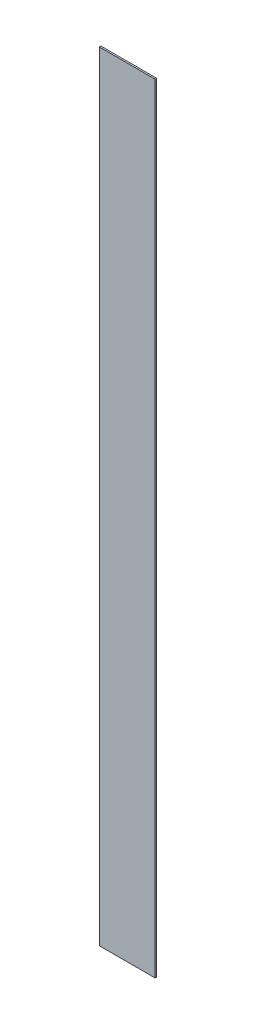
ISO-10303-21;
HEADER;
FILE_DESCRIPTION(('STEP AP214'),'2;1');
FILE_NAME('part.step','',(''),(''),'','','');
FILE_SCHEMA(('AUTOMOTIVE_DESIGN { 1 0 10303 214 1 1 1 1 }'));
ENDSEC;
DATA;
#1=APPLICATION_CONTEXT('core data for automotive mechanical design processes');
#2=APPLICATION_PROTOCOL_DEFINITION('international standard','automotive_design',2000,#1);
#3=PRODUCT_CONTEXT('',#1,'mechanical');
#4=PRODUCT('Part','Part','',(#3));
#5=PRODUCT_RELATED_PRODUCT_CATEGORY('part','',(#4));
#6=PRODUCT_DEFINITION_FORMATION('','',#4);
#7=PRODUCT_DEFINITION_CONTEXT('part definition',#1,'design');
#8=PRODUCT_DEFINITION('design','',#6,#7);
#9=PRODUCT_DEFINITION_SHAPE('','',#8);
#10=(LENGTH_UNIT() NAMED_UNIT(*) SI_UNIT(.MILLI.,.METRE.));
#11=(NAMED_UNIT(*) PLANE_ANGLE_UNIT() SI_UNIT($,.RADIAN.));
#12=(NAMED_UNIT(*) SI_UNIT($,.STERADIAN.) SOLID_ANGLE_UNIT());
#13=UNCERTAINTY_MEASURE_WITH_UNIT(LENGTH_MEASURE(1.E-05),#10,'distance_accuracy_value','');
#14=(GEOMETRIC_REPRESENTATION_CONTEXT(3) GLOBAL_UNCERTAINTY_ASSIGNED_CONTEXT((#13)) GLOBAL_UNIT_ASSIGNED_CONTEXT((#10,
#11,#12)) REPRESENTATION_CONTEXT('',''));
#15=CARTESIAN_POINT('',(0.,0.,0.));
#16=DIRECTION('',(0.,0.,1.));
#17=DIRECTION('',(1.,0.,0.));
#18=AXIS2_PLACEMENT_3D('',#15,#16,#17);
#19=CARTESIAN_POINT('',(-71.0000000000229,-184.799999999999,1.2));
#20=DIRECTION('',(1.,0.,0.));
#21=DIRECTION('',(0.,0.,-1.));
#22=AXIS2_PLACEMENT_3D('',#19,#20,#21);
#23=PLANE('',#22);
#24=DIRECTION('',(0.,-1.,0.));
#25=VECTOR('',#24,1.);
#26=CARTESIAN_POINT('',(-71.0000000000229,-184.799999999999,0.));
#27=LINE('',#26,#25);
#28=CARTESIAN_POINT('',(-71.0000000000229,400.200000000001,0.));
#29=VERTEX_POINT('',#28);
#30=CARTESIAN_POINT('',(-71.0000000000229,-184.799999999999,0.));
#31=VERTEX_POINT('',#30);
#32=EDGE_CURVE('E102',#29,#31,#27,.T.);
#33=ORIENTED_EDGE('',*,*,#32,.T.);
#34=DIRECTION('',(0.,0.,-1.));
#35=VECTOR('',#34,1.);
#36=CARTESIAN_POINT('',(-71.0000000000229,-184.799999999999,1.2));
#37=LINE('',#36,#35);
#38=CARTESIAN_POINT('',(-71.0000000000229,-184.799999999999,1.2));
#39=VERTEX_POINT('',#38);
#40=EDGE_CURVE('E11',#39,#31,#37,.T.);
#41=ORIENTED_EDGE('',*,*,#40,.F.);
#42=DIRECTION('',(0.,-1.,0.));
#43=VECTOR('',#42,1.);
#44=CARTESIAN_POINT('',(-71.0000000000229,-184.799999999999,1.2));
#45=LINE('',#44,#43);
#46=CARTESIAN_POINT('',(-71.0000000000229,400.200000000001,1.2));
#47=VERTEX_POINT('',#46);
#48=EDGE_CURVE('E90',#47,#39,#45,.T.);
#49=ORIENTED_EDGE('',*,*,#48,.F.);
#50=DIRECTION('',(0.,0.,-1.));
#51=VECTOR('',#50,1.);
#52=CARTESIAN_POINT('',(-71.0000000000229,400.200000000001,1.2));
#53=LINE('',#52,#51);
#54=EDGE_CURVE('E98',#47,#29,#53,.T.);
#55=ORIENTED_EDGE('',*,*,#54,.T.);
#56=EDGE_LOOP('',(#33,#41,#49,#55));
#57=FACE_BOUND('',#56,.T.);
#58=ADVANCED_FACE('F39',(#57),#23,.F.);
#59=CARTESIAN_POINT('',(-71.0000000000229,-184.799999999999,1.2));
#60=DIRECTION('',(0.,1.,0.));
#61=DIRECTION('',(0.,0.,1.));
#62=AXIS2_PLACEMENT_3D('',#59,#60,#61);
#63=PLANE('',#62);
#64=DIRECTION('',(1.,0.,0.));
#65=VECTOR('',#64,1.);
#66=CARTESIAN_POINT('',(-71.0000000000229,-184.799999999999,0.));
#67=LINE('',#66,#65);
#68=CARTESIAN_POINT('',(-29.0000000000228,-184.799999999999,0.));
#69=VERTEX_POINT('',#68);
#70=EDGE_CURVE('E94',#31,#69,#67,.T.);
#71=ORIENTED_EDGE('',*,*,#70,.T.);
#72=DIRECTION('',(0.,0.,-1.));
#73=VECTOR('',#72,1.);
#74=CARTESIAN_POINT('',(-29.0000000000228,-184.799999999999,1.2));
#75=LINE('',#74,#73);
#76=CARTESIAN_POINT('',(-29.0000000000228,-184.799999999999,1.2));
#77=VERTEX_POINT('',#76);
#78=EDGE_CURVE('E47',#77,#69,#75,.T.);
#79=ORIENTED_EDGE('',*,*,#78,.F.);
#80=DIRECTION('',(1.,0.,0.));
#81=VECTOR('',#80,1.);
#82=CARTESIAN_POINT('',(-71.0000000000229,-184.799999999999,1.2));
#83=LINE('',#82,#81);
#84=EDGE_CURVE('E85',#39,#77,#83,.T.);
#85=ORIENTED_EDGE('',*,*,#84,.F.);
#86=ORIENTED_EDGE('',*,*,#40,.T.);
#87=EDGE_LOOP('',(#71,#79,#85,#86));
#88=FACE_BOUND('',#87,.T.);
#89=ADVANCED_FACE('F93',(#88),#63,.F.);
#90=CARTESIAN_POINT('',(-29.0000000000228,-184.799999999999,1.2));
#91=DIRECTION('',(-1.,0.,0.));
#92=DIRECTION('',(0.,0.,1.));
#93=AXIS2_PLACEMENT_3D('',#90,#91,#92);
#94=PLANE('',#93);
#95=DIRECTION('',(0.,1.,0.));
#96=VECTOR('',#95,1.);
#97=CARTESIAN_POINT('',(-29.0000000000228,-184.799999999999,0.));
#98=LINE('',#97,#96);
#99=CARTESIAN_POINT('',(-29.0000000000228,400.200000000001,0.));
#100=VERTEX_POINT('',#99);
#101=EDGE_CURVE('E72',#69,#100,#98,.T.);
#102=ORIENTED_EDGE('',*,*,#101,.T.);
#103=DIRECTION('',(0.,0.,-1.));
#104=VECTOR('',#103,1.);
#105=CARTESIAN_POINT('',(-29.0000000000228,400.200000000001,1.2));
#106=LINE('',#105,#104);
#107=CARTESIAN_POINT('',(-29.0000000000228,400.200000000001,1.2));
#108=VERTEX_POINT('',#107);
#109=EDGE_CURVE('E95',#108,#100,#106,.T.);
#110=ORIENTED_EDGE('',*,*,#109,.F.);
#111=DIRECTION('',(0.,1.,0.));
#112=VECTOR('',#111,1.);
#113=CARTESIAN_POINT('',(-29.0000000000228,-184.799999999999,1.2));
#114=LINE('',#113,#112);
#115=EDGE_CURVE('E88',#77,#108,#114,.T.);
#116=ORIENTED_EDGE('',*,*,#115,.F.);
#117=ORIENTED_EDGE('',*,*,#78,.T.);
#118=EDGE_LOOP('',(#102,#110,#116,#117));
#119=FACE_BOUND('',#118,.T.);
#120=ADVANCED_FACE('F96',(#119),#94,.F.);
#121=CARTESIAN_POINT('',(-71.0000000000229,400.200000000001,1.2));
#122=DIRECTION('',(0.,-1.,0.));
#123=DIRECTION('',(0.,0.,-1.));
#124=AXIS2_PLACEMENT_3D('',#121,#122,#123);
#125=PLANE('',#124);
#126=DIRECTION('',(-1.,0.,0.));
#127=VECTOR('',#126,1.);
#128=CARTESIAN_POINT('',(-71.0000000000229,400.200000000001,0.));
#129=LINE('',#128,#127);
#130=EDGE_CURVE('E78',#100,#29,#129,.T.);
#131=ORIENTED_EDGE('',*,*,#130,.T.);
#132=ORIENTED_EDGE('',*,*,#54,.F.);
#133=DIRECTION('',(-1.,0.,0.));
#134=VECTOR('',#133,1.);
#135=CARTESIAN_POINT('',(-71.0000000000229,400.200000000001,1.2));
#136=LINE('',#135,#134);
#137=EDGE_CURVE('E55',#108,#47,#136,.T.);
#138=ORIENTED_EDGE('',*,*,#137,.F.);
#139=ORIENTED_EDGE('',*,*,#109,.T.);
#140=EDGE_LOOP('',(#131,#132,#138,#139));
#141=FACE_BOUND('',#140,.T.);
#142=ADVANCED_FACE('F109',(#141),#125,.F.);
#143=CARTESIAN_POINT('',(0.,0.,1.2));
#144=DIRECTION('',(0.,0.,-1.));
#145=DIRECTION('',(-1.,0.,0.));
#146=AXIS2_PLACEMENT_3D('',#143,#144,#145);
#147=PLANE('',#146);
#148=ORIENTED_EDGE('',*,*,#48,.T.);
#149=ORIENTED_EDGE('',*,*,#84,.T.);
#150=ORIENTED_EDGE('',*,*,#115,.T.);
#151=ORIENTED_EDGE('',*,*,#137,.T.);
#152=EDGE_LOOP('',(#148,#149,#150,#151));
#153=FACE_BOUND('',#152,.T.);
#154=ADVANCED_FACE('F86',(#153),#147,.F.);
#155=CARTESIAN_POINT('',(0.,0.,0.));
#156=DIRECTION('',(0.,0.,-1.));
#157=DIRECTION('',(-1.,0.,0.));
#158=AXIS2_PLACEMENT_3D('',#155,#156,#157);
#159=PLANE('',#158);
#160=ORIENTED_EDGE('',*,*,#32,.F.);
#161=ORIENTED_EDGE('',*,*,#130,.F.);
#162=ORIENTED_EDGE('',*,*,#101,.F.);
#163=ORIENTED_EDGE('',*,*,#70,.F.);
#164=EDGE_LOOP('',(#160,#161,#162,#163));
#165=FACE_BOUND('',#164,.T.);
#166=ADVANCED_FACE('F112',(#165),#159,.T.);
#167=CLOSED_SHELL('',(#58,#89,#120,#142,#154,#166));
#168=MANIFOLD_SOLID_BREP('B2',#167);
#169=ADVANCED_BREP_SHAPE_REPRESENTATION('',(#18,#168),#14);
#170=SHAPE_DEFINITION_REPRESENTATION(#9,#169);
ENDSEC;
END-ISO-10303-21;
